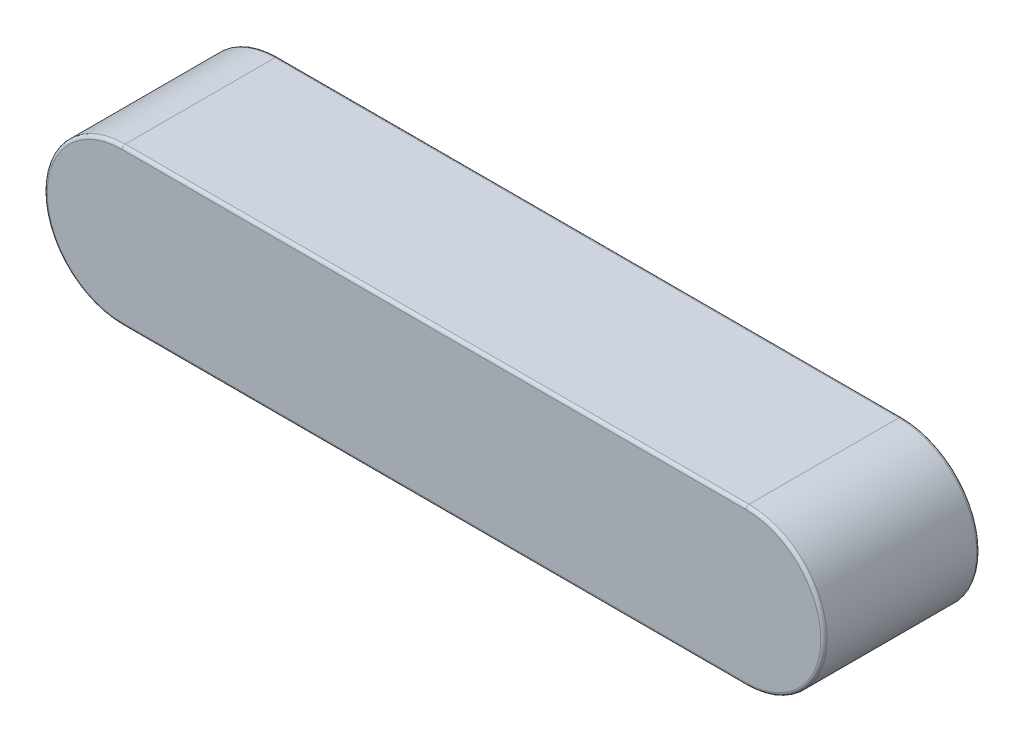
ISO-10303-21;
HEADER;
FILE_DESCRIPTION(('STEP AP214'),'2;1');
FILE_NAME('part.step','',(''),(''),'','','');
FILE_SCHEMA(('AUTOMOTIVE_DESIGN { 1 0 10303 214 1 1 1 1 }'));
ENDSEC;
DATA;
#1=APPLICATION_CONTEXT('core data for automotive mechanical design processes');
#2=APPLICATION_PROTOCOL_DEFINITION('international standard','automotive_design',2000,#1);
#3=PRODUCT_CONTEXT('',#1,'mechanical');
#4=PRODUCT('Part','Part','',(#3));
#5=PRODUCT_RELATED_PRODUCT_CATEGORY('part','',(#4));
#6=PRODUCT_DEFINITION_FORMATION('','',#4);
#7=PRODUCT_DEFINITION_CONTEXT('part definition',#1,'design');
#8=PRODUCT_DEFINITION('design','',#6,#7);
#9=PRODUCT_DEFINITION_SHAPE('','',#8);
#10=(LENGTH_UNIT() NAMED_UNIT(*) SI_UNIT(.MILLI.,.METRE.));
#11=(NAMED_UNIT(*) PLANE_ANGLE_UNIT() SI_UNIT($,.RADIAN.));
#12=(NAMED_UNIT(*) SI_UNIT($,.STERADIAN.) SOLID_ANGLE_UNIT());
#13=UNCERTAINTY_MEASURE_WITH_UNIT(LENGTH_MEASURE(1.E-05),#10,'distance_accuracy_value','');
#14=(GEOMETRIC_REPRESENTATION_CONTEXT(3) GLOBAL_UNCERTAINTY_ASSIGNED_CONTEXT((#13)) GLOBAL_UNIT_ASSIGNED_CONTEXT((#10,
#11,#12)) REPRESENTATION_CONTEXT('',''));
#15=CARTESIAN_POINT('',(0.,0.,0.));
#16=DIRECTION('',(0.,0.,1.));
#17=DIRECTION('',(1.,0.,0.));
#18=AXIS2_PLACEMENT_3D('',#15,#16,#17);
#19=CARTESIAN_POINT('',(0.,0.,5.));
#20=DIRECTION('',(0.,0.,1.));
#21=DIRECTION('',(1.,0.,0.));
#22=AXIS2_PLACEMENT_3D('',#19,#20,#21);
#23=PLANE('',#22);
#24=DIRECTION('',(1.,0.,0.));
#25=VECTOR('',#24,1.);
#26=CARTESIAN_POINT('',(-5.,2.4,5.));
#27=LINE('',#26,#25);
#28=CARTESIAN_POINT('',(-10.,2.4,5.));
#29=VERTEX_POINT('',#28);
#30=CARTESIAN_POINT('',(10.,2.4,5.));
#31=VERTEX_POINT('',#30);
#32=EDGE_CURVE('E80',#29,#31,#27,.T.);
#33=ORIENTED_EDGE('',*,*,#32,.F.);
#34=CARTESIAN_POINT('',(-10.,0.,5.));
#35=DIRECTION('',(0.,0.,-1.));
#36=DIRECTION('',(0.,-1.,0.));
#37=AXIS2_PLACEMENT_3D('',#34,#35,#36);
#38=CIRCLE('',#37,2.4);
#39=CARTESIAN_POINT('',(-10.,-2.4,5.));
#40=VERTEX_POINT('',#39);
#41=EDGE_CURVE('E118',#40,#29,#38,.T.);
#42=ORIENTED_EDGE('',*,*,#41,.F.);
#43=DIRECTION('',(-1.,0.,0.));
#44=VECTOR('',#43,1.);
#45=CARTESIAN_POINT('',(5.,-2.4,5.));
#46=LINE('',#45,#44);
#47=CARTESIAN_POINT('',(10.,-2.4,5.));
#48=VERTEX_POINT('',#47);
#49=EDGE_CURVE('E102',#48,#40,#46,.T.);
#50=ORIENTED_EDGE('',*,*,#49,.F.);
#51=CARTESIAN_POINT('',(10.,0.,5.));
#52=DIRECTION('',(0.,0.,-1.));
#53=DIRECTION('',(0.,1.,0.));
#54=AXIS2_PLACEMENT_3D('',#51,#52,#53);
#55=CIRCLE('',#54,2.4);
#56=EDGE_CURVE('E94',#31,#48,#55,.T.);
#57=ORIENTED_EDGE('',*,*,#56,.F.);
#58=EDGE_LOOP('',(#33,#42,#50,#57));
#59=FACE_BOUND('',#58,.T.);
#60=ADVANCED_FACE('F16',(#59),#23,.T.);
#61=CARTESIAN_POINT('',(-5.,2.4,4.9));
#62=DIRECTION('',(1.,0.,0.));
#63=DIRECTION('',(0.,1.,0.));
#64=AXIS2_PLACEMENT_3D('',#61,#62,#63);
#65=CYLINDRICAL_SURFACE('',#64,0.1);
#66=CARTESIAN_POINT('',(-10.,2.4,4.9));
#67=DIRECTION('',(1.,0.,0.));
#68=DIRECTION('',(0.,1.,0.));
#69=AXIS2_PLACEMENT_3D('',#66,#67,#68);
#70=CIRCLE('',#69,0.1);
#71=CARTESIAN_POINT('',(-10.,2.5,4.9));
#72=VERTEX_POINT('',#71);
#73=EDGE_CURVE('E86',#29,#72,#70,.F.);
#74=ORIENTED_EDGE('',*,*,#73,.F.);
#75=ORIENTED_EDGE('',*,*,#32,.T.);
#76=CARTESIAN_POINT('',(10.,2.4,4.9));
#77=DIRECTION('',(1.,0.,0.));
#78=DIRECTION('',(0.,1.,0.));
#79=AXIS2_PLACEMENT_3D('',#76,#77,#78);
#80=CIRCLE('',#79,0.1);
#81=CARTESIAN_POINT('',(10.,2.5,4.9));
#82=VERTEX_POINT('',#81);
#83=EDGE_CURVE('E84',#82,#31,#80,.T.);
#84=ORIENTED_EDGE('',*,*,#83,.F.);
#85=DIRECTION('',(1.,0.,0.));
#86=VECTOR('',#85,1.);
#87=CARTESIAN_POINT('',(-10.,2.5,4.9));
#88=LINE('',#87,#86);
#89=EDGE_CURVE('E150',#72,#82,#88,.T.);
#90=ORIENTED_EDGE('',*,*,#89,.F.);
#91=EDGE_LOOP('',(#74,#75,#84,#90));
#92=FACE_BOUND('',#91,.T.);
#93=ADVANCED_FACE('F82',(#92),#65,.T.);
#94=CARTESIAN_POINT('',(-10.,0.,4.9));
#95=DIRECTION('',(0.,0.,-1.));
#96=DIRECTION('',(-1.,0.,0.));
#97=AXIS2_PLACEMENT_3D('',#94,#95,#96);
#98=TOROIDAL_SURFACE('',#97,2.4,0.1);
#99=CARTESIAN_POINT('',(-10.,-2.4,4.9));
#100=DIRECTION('',(-1.,0.,0.));
#101=DIRECTION('',(0.,-1.,0.));
#102=AXIS2_PLACEMENT_3D('',#99,#100,#101);
#103=CIRCLE('',#102,0.1);
#104=CARTESIAN_POINT('',(-10.,-2.5,4.9));
#105=VERTEX_POINT('',#104);
#106=EDGE_CURVE('E99',#40,#105,#103,.F.);
#107=ORIENTED_EDGE('',*,*,#106,.F.);
#108=ORIENTED_EDGE('',*,*,#41,.T.);
#109=ORIENTED_EDGE('',*,*,#73,.T.);
#110=CARTESIAN_POINT('',(-10.,0.,4.9));
#111=DIRECTION('',(0.,0.,1.));
#112=DIRECTION('',(1.,0.,0.));
#113=AXIS2_PLACEMENT_3D('',#110,#111,#112);
#114=CIRCLE('',#113,2.5);
#115=EDGE_CURVE('E156',#105,#72,#114,.F.);
#116=ORIENTED_EDGE('',*,*,#115,.F.);
#117=EDGE_LOOP('',(#107,#108,#109,#116));
#118=FACE_BOUND('',#117,.T.);
#119=ADVANCED_FACE('F166',(#118),#98,.T.);
#120=CARTESIAN_POINT('',(5.,-2.4,4.9));
#121=DIRECTION('',(-1.,0.,0.));
#122=DIRECTION('',(0.,-1.,0.));
#123=AXIS2_PLACEMENT_3D('',#120,#121,#122);
#124=CYLINDRICAL_SURFACE('',#123,0.1);
#125=ORIENTED_EDGE('',*,*,#106,.T.);
#126=DIRECTION('',(1.,0.,0.));
#127=VECTOR('',#126,1.);
#128=CARTESIAN_POINT('',(10.,-2.5,4.9));
#129=LINE('',#128,#127);
#130=CARTESIAN_POINT('',(10.,-2.5,4.9));
#131=VERTEX_POINT('',#130);
#132=EDGE_CURVE('E281',#131,#105,#129,.F.);
#133=ORIENTED_EDGE('',*,*,#132,.F.);
#134=CARTESIAN_POINT('',(10.,-2.4,4.9));
#135=DIRECTION('',(-1.,0.,0.));
#136=DIRECTION('',(0.,-1.,0.));
#137=AXIS2_PLACEMENT_3D('',#134,#135,#136);
#138=CIRCLE('',#137,0.1);
#139=EDGE_CURVE('E104',#48,#131,#138,.F.);
#140=ORIENTED_EDGE('',*,*,#139,.F.);
#141=ORIENTED_EDGE('',*,*,#49,.T.);
#142=EDGE_LOOP('',(#125,#133,#140,#141));
#143=FACE_BOUND('',#142,.T.);
#144=ADVANCED_FACE('F143',(#143),#124,.T.);
#145=CARTESIAN_POINT('',(10.,0.,4.9));
#146=DIRECTION('',(0.,0.,-1.));
#147=DIRECTION('',(-1.,0.,0.));
#148=AXIS2_PLACEMENT_3D('',#145,#146,#147);
#149=TOROIDAL_SURFACE('',#148,2.4,0.1);
#150=ORIENTED_EDGE('',*,*,#139,.T.);
#151=CARTESIAN_POINT('',(10.,0.,4.9));
#152=DIRECTION('',(0.,0.,1.));
#153=DIRECTION('',(1.,0.,0.));
#154=AXIS2_PLACEMENT_3D('',#151,#152,#153);
#155=CIRCLE('',#154,2.5);
#156=EDGE_CURVE('E98',#82,#131,#155,.F.);
#157=ORIENTED_EDGE('',*,*,#156,.F.);
#158=ORIENTED_EDGE('',*,*,#83,.T.);
#159=ORIENTED_EDGE('',*,*,#56,.T.);
#160=EDGE_LOOP('',(#150,#157,#158,#159));
#161=FACE_BOUND('',#160,.T.);
#162=ADVANCED_FACE('F93',(#161),#149,.T.);
#163=CARTESIAN_POINT('',(-10.,2.5,0.));
#164=DIRECTION('',(0.,1.,0.));
#165=DIRECTION('',(0.,0.,1.));
#166=AXIS2_PLACEMENT_3D('',#163,#164,#165);
#167=PLANE('',#166);
#168=ORIENTED_EDGE('',*,*,#89,.T.);
#169=DIRECTION('',(0.,0.,1.));
#170=VECTOR('',#169,1.);
#171=CARTESIAN_POINT('',(10.,2.5,0.));
#172=LINE('',#171,#170);
#173=CARTESIAN_POINT('',(10.,2.5,0.1));
#174=VERTEX_POINT('',#173);
#175=EDGE_CURVE('E273',#174,#82,#172,.T.);
#176=ORIENTED_EDGE('',*,*,#175,.F.);
#177=DIRECTION('',(-1.,0.,0.));
#178=VECTOR('',#177,1.);
#179=CARTESIAN_POINT('',(-5.,2.5,0.1));
#180=LINE('',#179,#178);
#181=CARTESIAN_POINT('',(-10.,2.5,0.1));
#182=VERTEX_POINT('',#181);
#183=EDGE_CURVE('E270',#182,#174,#180,.F.);
#184=ORIENTED_EDGE('',*,*,#183,.F.);
#185=DIRECTION('',(0.,0.,1.));
#186=VECTOR('',#185,1.);
#187=CARTESIAN_POINT('',(-10.,2.5,0.));
#188=LINE('',#187,#186);
#189=EDGE_CURVE('E159',#72,#182,#188,.F.);
#190=ORIENTED_EDGE('',*,*,#189,.F.);
#191=EDGE_LOOP('',(#168,#176,#184,#190));
#192=FACE_BOUND('',#191,.T.);
#193=ADVANCED_FACE('F142',(#192),#167,.T.);
#194=CARTESIAN_POINT('',(-10.,0.,0.));
#195=DIRECTION('',(0.,0.,1.));
#196=DIRECTION('',(1.,0.,0.));
#197=AXIS2_PLACEMENT_3D('',#194,#195,#196);
#198=CYLINDRICAL_SURFACE('',#197,2.5);
#199=ORIENTED_EDGE('',*,*,#115,.T.);
#200=ORIENTED_EDGE('',*,*,#189,.T.);
#201=CARTESIAN_POINT('',(-10.,0.,0.1));
#202=DIRECTION('',(0.,0.,1.));
#203=DIRECTION('',(1.,0.,0.));
#204=AXIS2_PLACEMENT_3D('',#201,#202,#203);
#205=CIRCLE('',#204,2.5);
#206=CARTESIAN_POINT('',(-10.,-2.5,0.1));
#207=VERTEX_POINT('',#206);
#208=EDGE_CURVE('E267',#207,#182,#205,.F.);
#209=ORIENTED_EDGE('',*,*,#208,.F.);
#210=DIRECTION('',(0.,0.,-1.));
#211=VECTOR('',#210,1.);
#212=CARTESIAN_POINT('',(-10.,-2.5,0.));
#213=LINE('',#212,#211);
#214=EDGE_CURVE('E276',#105,#207,#213,.T.);
#215=ORIENTED_EDGE('',*,*,#214,.F.);
#216=EDGE_LOOP('',(#199,#200,#209,#215));
#217=FACE_BOUND('',#216,.T.);
#218=ADVANCED_FACE('F295',(#217),#198,.T.);
#219=CARTESIAN_POINT('',(10.,-2.5,0.));
#220=DIRECTION('',(0.,-1.,0.));
#221=DIRECTION('',(0.,0.,-1.));
#222=AXIS2_PLACEMENT_3D('',#219,#220,#221);
#223=PLANE('',#222);
#224=ORIENTED_EDGE('',*,*,#132,.T.);
#225=ORIENTED_EDGE('',*,*,#214,.T.);
#226=DIRECTION('',(1.,0.,0.));
#227=VECTOR('',#226,1.);
#228=CARTESIAN_POINT('',(5.,-2.5,0.1));
#229=LINE('',#228,#227);
#230=CARTESIAN_POINT('',(10.,-2.5,0.1));
#231=VERTEX_POINT('',#230);
#232=EDGE_CURVE('E237',#231,#207,#229,.F.);
#233=ORIENTED_EDGE('',*,*,#232,.F.);
#234=DIRECTION('',(0.,0.,1.));
#235=VECTOR('',#234,1.);
#236=CARTESIAN_POINT('',(10.,-2.5,0.));
#237=LINE('',#236,#235);
#238=EDGE_CURVE('E272',#131,#231,#237,.F.);
#239=ORIENTED_EDGE('',*,*,#238,.F.);
#240=EDGE_LOOP('',(#224,#225,#233,#239));
#241=FACE_BOUND('',#240,.T.);
#242=ADVANCED_FACE('F289',(#241),#223,.T.);
#243=CARTESIAN_POINT('',(10.,0.,0.));
#244=DIRECTION('',(0.,0.,1.));
#245=DIRECTION('',(1.,0.,0.));
#246=AXIS2_PLACEMENT_3D('',#243,#244,#245);
#247=CYLINDRICAL_SURFACE('',#246,2.5);
#248=ORIENTED_EDGE('',*,*,#156,.T.);
#249=ORIENTED_EDGE('',*,*,#238,.T.);
#250=CARTESIAN_POINT('',(10.,0.,0.1));
#251=DIRECTION('',(0.,0.,1.));
#252=DIRECTION('',(1.,0.,0.));
#253=AXIS2_PLACEMENT_3D('',#250,#251,#252);
#254=CIRCLE('',#253,2.5);
#255=EDGE_CURVE('E223',#174,#231,#254,.F.);
#256=ORIENTED_EDGE('',*,*,#255,.F.);
#257=ORIENTED_EDGE('',*,*,#175,.T.);
#258=EDGE_LOOP('',(#248,#249,#256,#257));
#259=FACE_BOUND('',#258,.T.);
#260=ADVANCED_FACE('F304',(#259),#247,.T.);
#261=CARTESIAN_POINT('',(-5.,2.4,0.1));
#262=DIRECTION('',(-1.,0.,0.));
#263=DIRECTION('',(0.,-1.,0.));
#264=AXIS2_PLACEMENT_3D('',#261,#262,#263);
#265=CYLINDRICAL_SURFACE('',#264,0.1);
#266=CARTESIAN_POINT('',(10.,2.4,0.1));
#267=DIRECTION('',(-1.,0.,0.));
#268=DIRECTION('',(0.,1.,0.));
#269=AXIS2_PLACEMENT_3D('',#266,#267,#268);
#270=CIRCLE('',#269,0.1);
#271=CARTESIAN_POINT('',(10.,2.4,0.));
#272=VERTEX_POINT('',#271);
#273=EDGE_CURVE('E236',#272,#174,#270,.F.);
#274=ORIENTED_EDGE('',*,*,#273,.F.);
#275=DIRECTION('',(1.,0.,0.));
#276=VECTOR('',#275,1.);
#277=CARTESIAN_POINT('',(0.,2.4,0.));
#278=LINE('',#277,#276);
#279=CARTESIAN_POINT('',(-10.,2.4,0.));
#280=VERTEX_POINT('',#279);
#281=EDGE_CURVE('E210',#272,#280,#278,.F.);
#282=ORIENTED_EDGE('',*,*,#281,.T.);
#283=CARTESIAN_POINT('',(-10.,2.4,0.1));
#284=DIRECTION('',(-1.,0.,0.));
#285=DIRECTION('',(0.,1.,0.));
#286=AXIS2_PLACEMENT_3D('',#283,#284,#285);
#287=CIRCLE('',#286,0.1);
#288=EDGE_CURVE('E244',#182,#280,#287,.T.);
#289=ORIENTED_EDGE('',*,*,#288,.F.);
#290=ORIENTED_EDGE('',*,*,#183,.T.);
#291=EDGE_LOOP('',(#274,#282,#289,#290));
#292=FACE_BOUND('',#291,.T.);
#293=ADVANCED_FACE('F255',(#292),#265,.T.);
#294=CARTESIAN_POINT('',(-10.,0.,0.1));
#295=DIRECTION('',(0.,0.,1.));
#296=DIRECTION('',(1.,0.,0.));
#297=AXIS2_PLACEMENT_3D('',#294,#295,#296);
#298=TOROIDAL_SURFACE('',#297,2.4,0.1);
#299=ORIENTED_EDGE('',*,*,#288,.T.);
#300=CARTESIAN_POINT('',(-10.,0.,0.));
#301=DIRECTION('',(0.,0.,1.));
#302=DIRECTION('',(0.,1.,0.));
#303=AXIS2_PLACEMENT_3D('',#300,#301,#302);
#304=CIRCLE('',#303,2.4);
#305=CARTESIAN_POINT('',(-10.,-2.4,0.));
#306=VERTEX_POINT('',#305);
#307=EDGE_CURVE('E218',#280,#306,#304,.T.);
#308=ORIENTED_EDGE('',*,*,#307,.T.);
#309=CARTESIAN_POINT('',(-10.,-2.4,0.1));
#310=DIRECTION('',(1.,0.,0.));
#311=DIRECTION('',(0.,1.,0.));
#312=AXIS2_PLACEMENT_3D('',#309,#310,#311);
#313=CIRCLE('',#312,0.1);
#314=EDGE_CURVE('E217',#207,#306,#313,.T.);
#315=ORIENTED_EDGE('',*,*,#314,.F.);
#316=ORIENTED_EDGE('',*,*,#208,.T.);
#317=EDGE_LOOP('',(#299,#308,#315,#316));
#318=FACE_BOUND('',#317,.T.);
#319=ADVANCED_FACE('F251',(#318),#298,.T.);
#320=CARTESIAN_POINT('',(5.,-2.4,0.1));
#321=DIRECTION('',(1.,0.,0.));
#322=DIRECTION('',(0.,1.,0.));
#323=AXIS2_PLACEMENT_3D('',#320,#321,#322);
#324=CYLINDRICAL_SURFACE('',#323,0.1);
#325=CARTESIAN_POINT('',(10.,-2.4,0.1));
#326=DIRECTION('',(1.,0.,0.));
#327=DIRECTION('',(0.,-1.,0.));
#328=AXIS2_PLACEMENT_3D('',#325,#326,#327);
#329=CIRCLE('',#328,0.1);
#330=CARTESIAN_POINT('',(10.,-2.4,0.));
#331=VERTEX_POINT('',#330);
#332=EDGE_CURVE('E35',#231,#331,#329,.T.);
#333=ORIENTED_EDGE('',*,*,#332,.F.);
#334=ORIENTED_EDGE('',*,*,#232,.T.);
#335=ORIENTED_EDGE('',*,*,#314,.T.);
#336=DIRECTION('',(1.,0.,0.));
#337=VECTOR('',#336,1.);
#338=CARTESIAN_POINT('',(0.,-2.4,0.));
#339=LINE('',#338,#337);
#340=EDGE_CURVE('E28',#306,#331,#339,.T.);
#341=ORIENTED_EDGE('',*,*,#340,.T.);
#342=EDGE_LOOP('',(#333,#334,#335,#341));
#343=FACE_BOUND('',#342,.T.);
#344=ADVANCED_FACE('F183',(#343),#324,.T.);
#345=CARTESIAN_POINT('',(10.,0.,0.1));
#346=DIRECTION('',(0.,0.,1.));
#347=DIRECTION('',(1.,0.,0.));
#348=AXIS2_PLACEMENT_3D('',#345,#346,#347);
#349=TOROIDAL_SURFACE('',#348,2.4,0.1);
#350=ORIENTED_EDGE('',*,*,#273,.T.);
#351=ORIENTED_EDGE('',*,*,#255,.T.);
#352=ORIENTED_EDGE('',*,*,#332,.T.);
#353=CARTESIAN_POINT('',(10.,0.,0.));
#354=DIRECTION('',(0.,0.,1.));
#355=DIRECTION('',(0.,-1.,0.));
#356=AXIS2_PLACEMENT_3D('',#353,#354,#355);
#357=CIRCLE('',#356,2.4);
#358=EDGE_CURVE('E11',#331,#272,#357,.T.);
#359=ORIENTED_EDGE('',*,*,#358,.T.);
#360=EDGE_LOOP('',(#350,#351,#352,#359));
#361=FACE_BOUND('',#360,.T.);
#362=ADVANCED_FACE('F177',(#361),#349,.T.);
#363=CARTESIAN_POINT('',(0.,0.,0.));
#364=DIRECTION('',(0.,0.,1.));
#365=DIRECTION('',(1.,0.,0.));
#366=AXIS2_PLACEMENT_3D('',#363,#364,#365);
#367=PLANE('',#366);
#368=ORIENTED_EDGE('',*,*,#340,.F.);
#369=ORIENTED_EDGE('',*,*,#307,.F.);
#370=ORIENTED_EDGE('',*,*,#281,.F.);
#371=ORIENTED_EDGE('',*,*,#358,.F.);
#372=EDGE_LOOP('',(#368,#369,#370,#371));
#373=FACE_BOUND('',#372,.T.);
#374=ADVANCED_FACE('F175',(#373),#367,.F.);
#375=CLOSED_SHELL('',(#60,#93,#119,#144,#162,#193,#218,#242,#260,#293,#319,#344,#362,#374));
#376=MANIFOLD_SOLID_BREP('B1',#375);
#377=ADVANCED_BREP_SHAPE_REPRESENTATION('',(#18,#376),#14);
#378=SHAPE_DEFINITION_REPRESENTATION(#9,#377);
ENDSEC;
END-ISO-10303-21;
